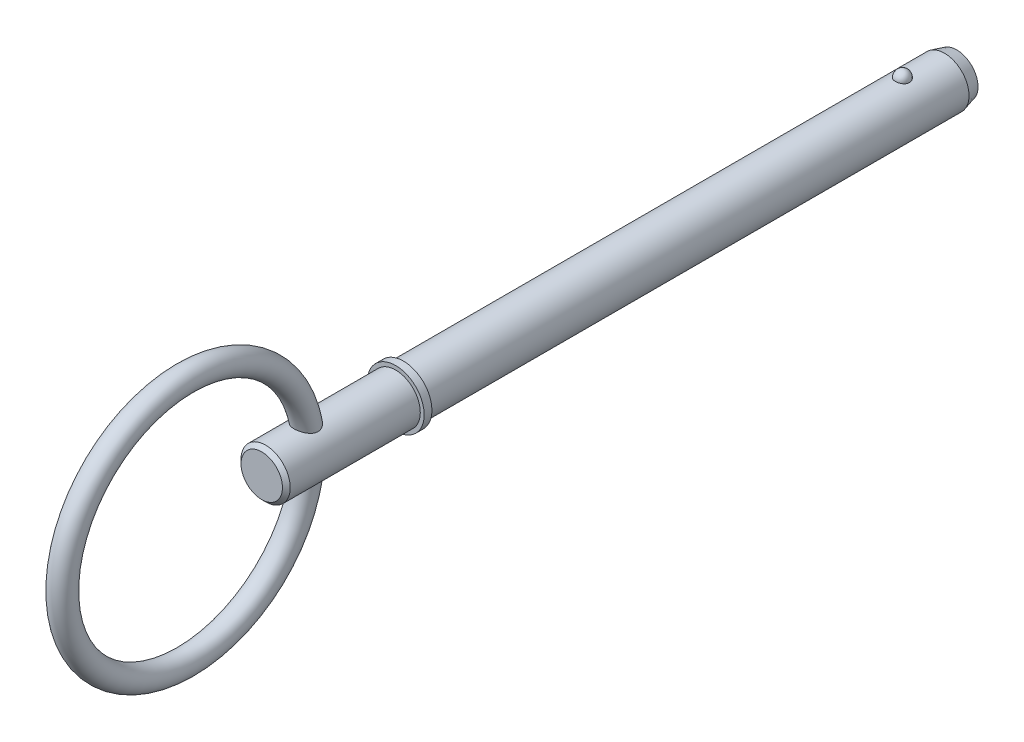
ISO-10303-21;
HEADER;
FILE_DESCRIPTION(('STEP AP214'),'2;1');
FILE_NAME('part.step','',(''),(''),'','','');
FILE_SCHEMA(('AUTOMOTIVE_DESIGN { 1 0 10303 214 1 1 1 1 }'));
ENDSEC;
DATA;
#1=APPLICATION_CONTEXT('core data for automotive mechanical design processes');
#2=APPLICATION_PROTOCOL_DEFINITION('international standard','automotive_design',2000,#1);
#3=PRODUCT_CONTEXT('',#1,'mechanical');
#4=PRODUCT('Part','Part','',(#3));
#5=PRODUCT_RELATED_PRODUCT_CATEGORY('part','',(#4));
#6=PRODUCT_DEFINITION_FORMATION('','',#4);
#7=PRODUCT_DEFINITION_CONTEXT('part definition',#1,'design');
#8=PRODUCT_DEFINITION('design','',#6,#7);
#9=PRODUCT_DEFINITION_SHAPE('','',#8);
#10=(LENGTH_UNIT() NAMED_UNIT(*) SI_UNIT(.MILLI.,.METRE.));
#11=(NAMED_UNIT(*) PLANE_ANGLE_UNIT() SI_UNIT($,.RADIAN.));
#12=(NAMED_UNIT(*) SI_UNIT($,.STERADIAN.) SOLID_ANGLE_UNIT());
#13=UNCERTAINTY_MEASURE_WITH_UNIT(LENGTH_MEASURE(1.E-05),#10,'distance_accuracy_value','');
#14=(GEOMETRIC_REPRESENTATION_CONTEXT(3) GLOBAL_UNCERTAINTY_ASSIGNED_CONTEXT((#13)) GLOBAL_UNIT_ASSIGNED_CONTEXT((#10,
#11,#12)) REPRESENTATION_CONTEXT('',''));
#15=CARTESIAN_POINT('',(0.,0.,0.));
#16=DIRECTION('',(0.,0.,1.));
#17=DIRECTION('',(1.,0.,0.));
#18=AXIS2_PLACEMENT_3D('',#15,#16,#17);
#19=CARTESIAN_POINT('',(0.,0.,63.5));
#20=DIRECTION('',(0.,0.,-1.));
#21=DIRECTION('',(-1.,0.,0.));
#22=AXIS2_PLACEMENT_3D('',#19,#20,#21);
#23=CYLINDRICAL_SURFACE('',#22,3.175);
#24=CARTESIAN_POINT('',(0.90060722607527,3.0445905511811,-0.910000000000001));
#25=CARTESIAN_POINT('',(0.90060646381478,3.04459122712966,-0.859144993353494));
#26=CARTESIAN_POINT('',(0.896466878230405,3.04582460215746,-0.808280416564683));
#27=CARTESIAN_POINT('',(0.88000740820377,3.05062019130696,-0.707994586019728));
#28=CARTESIAN_POINT('',(0.86768478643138,3.05418318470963,-0.658573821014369));
#29=CARTESIAN_POINT('',(0.835170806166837,3.06323316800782,-0.562604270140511));
#30=CARTESIAN_POINT('',(0.814982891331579,3.0687193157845,-0.516054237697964));
#31=CARTESIAN_POINT('',(0.767236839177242,3.08100268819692,-0.427093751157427));
#32=CARTESIAN_POINT('',(0.739678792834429,3.08779989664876,-0.384683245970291));
#33=CARTESIAN_POINT('',(0.677715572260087,3.10198953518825,-0.304951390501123));
#34=CARTESIAN_POINT('',(0.643275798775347,3.10938485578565,-0.267657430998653));
#35=CARTESIAN_POINT('',(0.568522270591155,3.12391647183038,-0.199446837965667));
#36=CARTESIAN_POINT('',(0.528208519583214,3.13105276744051,-0.168530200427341));
#37=CARTESIAN_POINT('',(0.442911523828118,3.14425008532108,-0.114021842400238));
#38=CARTESIAN_POINT('',(0.397942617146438,3.15031426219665,-0.0904084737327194));
#39=CARTESIAN_POINT('',(0.304493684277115,3.16071443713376,-0.051061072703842));
#40=CARTESIAN_POINT('',(0.256014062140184,3.1650506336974,-0.0353261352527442));
#41=CARTESIAN_POINT('',(0.15789136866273,3.17144549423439,-0.0124151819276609));
#42=CARTESIAN_POINT('',(0.108287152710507,3.1735453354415,-0.00508422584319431));
#43=CARTESIAN_POINT('',(0.0085070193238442,3.17538048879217,0.00133254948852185));
#44=CARTESIAN_POINT('',(-0.0416688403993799,3.17511603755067,0.000419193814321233));
#45=CARTESIAN_POINT('',(-0.140377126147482,3.17227395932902,-0.00954840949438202));
#46=CARTESIAN_POINT('',(-0.188922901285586,3.16973088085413,-0.0184810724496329));
#47=CARTESIAN_POINT('',(-0.283780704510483,3.16265029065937,-0.0440659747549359));
#48=CARTESIAN_POINT('',(-0.330092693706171,3.15811274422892,-0.0607183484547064));
#49=CARTESIAN_POINT('',(-0.419493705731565,3.1474895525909,-0.10140675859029));
#50=CARTESIAN_POINT('',(-0.462561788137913,3.14139480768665,-0.125486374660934));
#51=CARTESIAN_POINT('',(-0.54404237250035,3.12831396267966,-0.180346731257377));
#52=CARTESIAN_POINT('',(-0.582454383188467,3.12132776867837,-0.21112817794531));
#53=CARTESIAN_POINT('',(-0.654371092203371,3.10705591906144,-0.279257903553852));
#54=CARTESIAN_POINT('',(-0.687763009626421,3.09976707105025,-0.316724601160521));
#55=CARTESIAN_POINT('',(-0.747869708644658,3.08581767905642,-0.396782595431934));
#56=CARTESIAN_POINT('',(-0.774583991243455,3.07915718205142,-0.43937427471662));
#57=CARTESIAN_POINT('',(-0.820959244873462,3.06712152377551,-0.529074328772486));
#58=CARTESIAN_POINT('',(-0.840531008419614,3.06176288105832,-0.576231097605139));
#59=CARTESIAN_POINT('',(-0.871672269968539,3.0530437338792,-0.673291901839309));
#60=CARTESIAN_POINT('',(-0.883242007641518,3.04968316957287,-0.723195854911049));
#61=CARTESIAN_POINT('',(-0.898057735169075,3.04535343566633,-0.824104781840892));
#62=CARTESIAN_POINT('',(-0.901339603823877,3.04437395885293,-0.875104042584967));
#63=CARTESIAN_POINT('',(-0.89960137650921,3.04488803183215,-0.976947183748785));
#64=CARTESIAN_POINT('',(-0.894581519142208,3.04638151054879,-1.02779106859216));
#65=CARTESIAN_POINT('',(-0.876414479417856,3.051656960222,-1.12760218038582));
#66=CARTESIAN_POINT('',(-0.863310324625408,3.05542681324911,-1.17657789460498));
#67=CARTESIAN_POINT('',(-0.82933491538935,3.06482253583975,-1.27156757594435));
#68=CARTESIAN_POINT('',(-0.808463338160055,3.07044848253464,-1.31758141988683));
#69=CARTESIAN_POINT('',(-0.759325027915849,3.08296842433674,-1.40563218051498));
#70=CARTESIAN_POINT('',(-0.731017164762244,3.08986940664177,-1.44764515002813));
#71=CARTESIAN_POINT('',(-0.667767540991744,3.10415201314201,-1.52624913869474));
#72=CARTESIAN_POINT('',(-0.632825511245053,3.11153365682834,-1.56283993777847));
#73=CARTESIAN_POINT('',(-0.557049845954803,3.12598962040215,-1.62972906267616));
#74=CARTESIAN_POINT('',(-0.516193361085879,3.13306260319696,-1.66000181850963));
#75=CARTESIAN_POINT('',(-0.42979268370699,3.14607829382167,-1.7132172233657));
#76=CARTESIAN_POINT('',(-0.384248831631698,3.15202108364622,-1.73616040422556));
#77=CARTESIAN_POINT('',(-0.290370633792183,3.16204171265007,-1.77380927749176));
#78=CARTESIAN_POINT('',(-0.242079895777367,3.16614263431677,-1.7886174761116));
#79=CARTESIAN_POINT('',(-0.14357928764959,3.17213528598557,-1.81001390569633));
#80=CARTESIAN_POINT('',(-0.0933696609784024,3.1740272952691,-1.81660317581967));
#81=CARTESIAN_POINT('',(0.00648182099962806,3.17537830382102,-1.82132177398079));
#82=CARTESIAN_POINT('',(0.0561153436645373,3.17488455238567,-1.81961539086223));
#83=CARTESIAN_POINT('',(0.154368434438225,3.1716260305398,-1.80816900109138));
#84=CARTESIAN_POINT('',(0.202988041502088,3.16886134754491,-1.79842930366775));
#85=CARTESIAN_POINT('',(0.29764238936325,3.16137318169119,-1.77125024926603));
#86=CARTESIAN_POINT('',(0.343686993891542,3.15665785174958,-1.75384292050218));
#87=CARTESIAN_POINT('',(0.432167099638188,3.14576631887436,-1.71181408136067));
#88=CARTESIAN_POINT('',(0.474602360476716,3.13959001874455,-1.68719209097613));
#89=CARTESIAN_POINT('',(0.555408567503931,3.1263159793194,-1.63094218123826));
#90=CARTESIAN_POINT('',(0.593703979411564,3.11920512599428,-1.59920888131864));
#91=CARTESIAN_POINT('',(0.664472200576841,3.10490064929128,-1.52981493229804));
#92=CARTESIAN_POINT('',(0.696944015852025,3.09770701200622,-1.49215327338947));
#93=CARTESIAN_POINT('',(0.755798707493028,3.08388169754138,-1.41116434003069));
#94=CARTESIAN_POINT('',(0.782059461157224,3.07726269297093,-1.36774610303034));
#95=CARTESIAN_POINT('',(0.827051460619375,3.06547790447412,-1.27699966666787));
#96=CARTESIAN_POINT('',(0.845785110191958,3.06031165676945,-1.22967272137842));
#97=CARTESIAN_POINT('',(0.873798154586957,3.05242388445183,-1.13728658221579));
#98=CARTESIAN_POINT('',(0.883833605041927,3.04951005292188,-1.09247132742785));
#99=CARTESIAN_POINT('',(0.897238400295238,3.0455931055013,-1.00177329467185));
#100=CARTESIAN_POINT('',(0.900607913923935,3.0445899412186,-0.955890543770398));
#101=CARTESIAN_POINT('',(0.90060722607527,3.0445905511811,-0.910000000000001));
#102=B_SPLINE_CURVE_WITH_KNOTS('',3,(#24,#25,#26,#27,#28,#29,#30,#31,#32,#33,#34,#35,#36,#37,
#38,#39,#40,#41,#42,#43,#44,#45,#46,#47,#48,#49,#50,#51,#52,#53,#54,#55,#56,#57,#58,#59,#60,#61,
#62,#63,#64,#65,#66,#67,#68,#69,#70,#71,#72,#73,#74,#75,#76,#77,#78,#79,#80,#81,#82,#83,#84,#85,
#86,#87,#88,#89,#90,#91,#92,#93,#94,#95,#96,#97,#98,#99,#100,#101),.UNSPECIFIED.,.T.,.F.,(4,2,2,
2,2,2,2,2,2,2,2,2,2,2,2,2,2,2,2,2,2,2,2,2,2,2,2,2,2,2,2,2,2,2,2,2,2,2,4),(0.,0.152400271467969,
0.304851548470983,0.45723615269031,0.609618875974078,0.762787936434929,0.915956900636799,
1.06866739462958,1.22136034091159,1.37119044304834,1.52100555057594,1.66858689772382,
1.81617081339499,1.9646377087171,2.1131202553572,2.26455561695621,2.41600229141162,
2.5692805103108,2.72255413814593,2.87516308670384,3.02776764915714,3.1795669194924,
3.33137249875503,3.48403607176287,3.63670583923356,3.78998198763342,3.94324701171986,
4.09453370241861,4.24580126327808,4.39408543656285,4.5423639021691,4.69002878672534,
4.83770349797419,4.9877312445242,5.13778457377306,5.29058018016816,5.44332695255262,
5.58085340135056,5.71837636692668),.UNSPECIFIED.);
#103=CARTESIAN_POINT('',(0.90060722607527,3.0445905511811,-0.910000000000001));
#104=VERTEX_POINT('',#103);
#105=EDGE_CURVE('E100',#104,#104,#102,.T.);
#106=ORIENTED_EDGE('',*,*,#105,.T.);
#107=EDGE_LOOP('',(#106));
#108=FACE_BOUND('',#107,.T.);
#109=CARTESIAN_POINT('',(0.,0.,-6.33399999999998));
#110=DIRECTION('',(0.,0.,-1.));
#111=DIRECTION('',(-1.,0.,0.));
#112=AXIS2_PLACEMENT_3D('',#109,#110,#111);
#113=CIRCLE('',#112,3.175);
#114=CARTESIAN_POINT('',(-3.175,0.,-6.33399999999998));
#115=VERTEX_POINT('',#114);
#116=EDGE_CURVE('E108',#115,#115,#113,.F.);
#117=ORIENTED_EDGE('',*,*,#116,.T.);
#118=EDGE_LOOP('',(#117));
#119=FACE_BOUND('',#118,.T.);
#120=CARTESIAN_POINT('',(0.,0.,63.5));
#121=DIRECTION('',(0.,0.,1.));
#122=DIRECTION('',(1.,0.,0.));
#123=AXIS2_PLACEMENT_3D('',#120,#121,#122);
#124=CIRCLE('',#123,3.175);
#125=CARTESIAN_POINT('',(3.175,0.,63.5));
#126=VERTEX_POINT('',#125);
#127=EDGE_CURVE('E106',#126,#126,#124,.T.);
#128=ORIENTED_EDGE('',*,*,#127,.F.);
#129=EDGE_LOOP('',(#128));
#130=FACE_BOUND('',#129,.T.);
#131=ADVANCED_FACE('F39',(#108,#119,#130),#23,.T.);
#132=CARTESIAN_POINT('',(0.,0.,-7.92));
#133=DIRECTION('',(0.,0.,-1.));
#134=DIRECTION('',(-1.,0.,0.));
#135=AXIS2_PLACEMENT_3D('',#132,#133,#134);
#136=PLANE('',#135);
#137=CARTESIAN_POINT('',(0.,0.,-7.92));
#138=DIRECTION('',(0.,0.,-1.));
#139=DIRECTION('',(-1.,0.,0.));
#140=AXIS2_PLACEMENT_3D('',#137,#138,#139);
#141=CIRCLE('',#140,2.75003258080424);
#142=CARTESIAN_POINT('',(-2.75003258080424,0.,-7.92));
#143=VERTEX_POINT('',#142);
#144=EDGE_CURVE('E142',#143,#143,#141,.T.);
#145=ORIENTED_EDGE('',*,*,#144,.T.);
#146=EDGE_LOOP('',(#145));
#147=FACE_BOUND('',#146,.T.);
#148=ADVANCED_FACE('F86',(#147),#136,.T.);
#149=CARTESIAN_POINT('',(0.,0.,-7.92));
#150=DIRECTION('',(0.,0.,1.));
#151=DIRECTION('',(1.,0.,0.));
#152=AXIS2_PLACEMENT_3D('',#149,#150,#151);
#153=CONICAL_SURFACE('',#152,2.75003258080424,0.261799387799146);
#154=ORIENTED_EDGE('',*,*,#116,.F.);
#155=EDGE_LOOP('',(#154));
#156=FACE_BOUND('',#155,.T.);
#157=ORIENTED_EDGE('',*,*,#144,.F.);
#158=EDGE_LOOP('',(#157));
#159=FACE_BOUND('',#158,.T.);
#160=ADVANCED_FACE('F92',(#156,#159),#153,.T.);
#161=CARTESIAN_POINT('',(0.,3.175,-0.910000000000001));
#162=DIRECTION('',(0.,1.,0.));
#163=DIRECTION('',(0.,0.,-1.));
#164=AXIS2_PLACEMENT_3D('',#161,#162,#163);
#165=SPHERICAL_SURFACE('',#164,0.91);
#166=ORIENTED_EDGE('',*,*,#105,.F.);
#167=EDGE_LOOP('',(#166));
#168=FACE_BOUND('',#167,.T.);
#169=ADVANCED_FACE('F111',(#168),#165,.T.);
#170=CARTESIAN_POINT('',(0.,0.,63.5));
#171=DIRECTION('',(0.,0.,-1.));
#172=DIRECTION('',(-1.,0.,0.));
#173=AXIS2_PLACEMENT_3D('',#170,#171,#172);
#174=PLANE('',#173);
#175=ORIENTED_EDGE('',*,*,#127,.T.);
#176=EDGE_LOOP('',(#175));
#177=FACE_BOUND('',#176,.T.);
#178=CARTESIAN_POINT('',(0.,0.,63.5));
#179=DIRECTION('',(0.,0.,-1.));
#180=DIRECTION('',(-1.,0.,0.));
#181=AXIS2_PLACEMENT_3D('',#178,#179,#180);
#182=CIRCLE('',#181,3.675);
#183=CARTESIAN_POINT('',(-3.675,0.,63.5));
#184=VERTEX_POINT('',#183);
#185=EDGE_CURVE('E107',#184,#184,#182,.T.);
#186=ORIENTED_EDGE('',*,*,#185,.T.);
#187=EDGE_LOOP('',(#186));
#188=FACE_BOUND('',#187,.T.);
#189=ADVANCED_FACE('F115',(#177,#188),#174,.T.);
#190=CARTESIAN_POINT('',(0.,0.,33.7287874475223));
#191=DIRECTION('',(0.,0.,-1.));
#192=DIRECTION('',(-1.,0.,0.));
#193=AXIS2_PLACEMENT_3D('',#190,#191,#192);
#194=CYLINDRICAL_SURFACE('',#193,3.675);
#195=CARTESIAN_POINT('',(0.,0.,64.5));
#196=DIRECTION('',(0.,0.,-1.));
#197=DIRECTION('',(-1.,0.,0.));
#198=AXIS2_PLACEMENT_3D('',#195,#196,#197);
#199=CIRCLE('',#198,3.675);
#200=CARTESIAN_POINT('',(-3.675,0.,64.5));
#201=VERTEX_POINT('',#200);
#202=EDGE_CURVE('E132',#201,#201,#199,.T.);
#203=ORIENTED_EDGE('',*,*,#202,.T.);
#204=EDGE_LOOP('',(#203));
#205=FACE_BOUND('',#204,.T.);
#206=ORIENTED_EDGE('',*,*,#185,.F.);
#207=EDGE_LOOP('',(#206));
#208=FACE_BOUND('',#207,.T.);
#209=ADVANCED_FACE('F119',(#205,#208),#194,.T.);
#210=CARTESIAN_POINT('',(0.,3.675,64.5));
#211=DIRECTION('',(0.,0.,1.));
#212=DIRECTION('',(1.,0.,0.));
#213=AXIS2_PLACEMENT_3D('',#210,#211,#212);
#214=PLANE('',#213);
#215=CARTESIAN_POINT('',(0.,0.,64.5));
#216=DIRECTION('',(0.,0.,1.));
#217=DIRECTION('',(1.,0.,0.));
#218=AXIS2_PLACEMENT_3D('',#215,#216,#217);
#219=CIRCLE('',#218,3.175);
#220=CARTESIAN_POINT('',(3.175,0.,64.5));
#221=VERTEX_POINT('',#220);
#222=EDGE_CURVE('E110',#221,#221,#219,.T.);
#223=ORIENTED_EDGE('',*,*,#222,.F.);
#224=EDGE_LOOP('',(#223));
#225=FACE_BOUND('',#224,.T.);
#226=ORIENTED_EDGE('',*,*,#202,.F.);
#227=EDGE_LOOP('',(#226));
#228=FACE_BOUND('',#227,.T.);
#229=ADVANCED_FACE('F83',(#225,#228),#214,.T.);
#230=CARTESIAN_POINT('',(0.,0.,81.79));
#231=DIRECTION('',(0.,0.,-1.));
#232=DIRECTION('',(-1.,0.,0.));
#233=AXIS2_PLACEMENT_3D('',#230,#231,#232);
#234=CYLINDRICAL_SURFACE('',#233,3.175);
#235=CARTESIAN_POINT('',(-0.793622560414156,-3.07421343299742,74.7949618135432));
#236=CARTESIAN_POINT('',(-0.723928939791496,-3.09220199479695,74.7540743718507));
#237=CARTESIAN_POINT('',(-0.650537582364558,-3.10860299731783,74.7186572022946));
#238=CARTESIAN_POINT('',(-0.498225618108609,-3.13662262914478,74.65960803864));
#239=CARTESIAN_POINT('',(-0.41929921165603,-3.14823615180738,74.635988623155));
#240=CARTESIAN_POINT('',(-0.258022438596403,-3.16553731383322,74.6011787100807));
#241=CARTESIAN_POINT('',(-0.175668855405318,-3.17121924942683,74.5900001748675));
#242=CARTESIAN_POINT('',(-0.0100583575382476,-3.17606405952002,74.5804538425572));
#243=CARTESIAN_POINT('',(0.0731982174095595,-3.17522930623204,74.5820813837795));
#244=CARTESIAN_POINT('',(0.236345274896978,-3.16722178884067,74.5979075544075));
#245=CARTESIAN_POINT('',(0.316269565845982,-3.16018772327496,74.6118310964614));
#246=CARTESIAN_POINT('',(0.472429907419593,-3.14064183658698,74.6514871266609));
#247=CARTESIAN_POINT('',(0.548665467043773,-3.12812928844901,74.6772211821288));
#248=CARTESIAN_POINT('',(0.696533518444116,-3.0985857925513,74.7403145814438));
#249=CARTESIAN_POINT('',(0.768085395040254,-3.08149328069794,74.7778336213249));
#250=CARTESIAN_POINT('',(0.90366694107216,-3.04449595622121,74.863584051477));
#251=CARTESIAN_POINT('',(0.967693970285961,-3.02459016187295,74.9118191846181));
#252=CARTESIAN_POINT('',(1.08889306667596,-2.98315111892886,75.0200855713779));
#253=CARTESIAN_POINT('',(1.14572430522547,-2.96158491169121,75.0804869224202));
#254=CARTESIAN_POINT('',(1.24806454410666,-2.91993487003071,75.2106874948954));
#255=CARTESIAN_POINT('',(1.29357550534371,-2.89985077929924,75.2804850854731));
#256=CARTESIAN_POINT('',(1.37094214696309,-2.86407549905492,75.4262600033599));
#257=CARTESIAN_POINT('',(1.40307792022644,-2.84829687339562,75.5020662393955));
#258=CARTESIAN_POINT('',(1.45397574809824,-2.82265933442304,75.6589553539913));
#259=CARTESIAN_POINT('',(1.47274938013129,-2.81279529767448,75.7400335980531));
#260=CARTESIAN_POINT('',(1.49549698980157,-2.80076108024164,75.8979026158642));
#261=CARTESIAN_POINT('',(1.50056337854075,-2.79802369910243,75.9744958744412));
#262=CARTESIAN_POINT('',(1.49933665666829,-2.79868066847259,76.1275541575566));
#263=CARTESIAN_POINT('',(1.49304097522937,-2.80207640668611,76.2040191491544));
#264=CARTESIAN_POINT('',(1.46976618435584,-2.81435249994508,76.3552802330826));
#265=CARTESIAN_POINT('',(1.45272287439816,-2.82326580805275,76.4300634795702));
#266=CARTESIAN_POINT('',(1.40884990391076,-2.84541139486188,76.5760088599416));
#267=CARTESIAN_POINT('',(1.38201642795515,-2.85864535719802,76.6471695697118));
#268=CARTESIAN_POINT('',(1.31496449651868,-2.89016475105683,76.7946079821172));
#269=CARTESIAN_POINT('',(1.27338339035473,-2.9089013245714,76.8701693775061));
#270=CARTESIAN_POINT('',(1.17952729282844,-2.94820796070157,77.0139034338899));
#271=CARTESIAN_POINT('',(1.12723913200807,-2.96878026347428,77.0820668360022));
#272=CARTESIAN_POINT('',(1.00570728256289,-3.01228109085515,77.2173106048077));
#273=CARTESIAN_POINT('',(0.935174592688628,-3.03519170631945,77.2832498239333));
#274=CARTESIAN_POINT('',(0.782605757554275,-3.07805054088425,77.401321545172));
#275=CARTESIAN_POINT('',(0.700588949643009,-3.09800362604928,77.4534768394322));
#276=CARTESIAN_POINT('',(0.549003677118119,-3.12787153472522,77.5296423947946));
#277=CARTESIAN_POINT('',(0.481582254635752,-3.1390487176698,77.5574376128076));
#278=CARTESIAN_POINT('',(0.342696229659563,-3.15722518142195,77.6021563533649));
#279=CARTESIAN_POINT('',(0.27123564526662,-3.16422853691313,77.6190904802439));
#280=CARTESIAN_POINT('',(0.125873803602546,-3.17334230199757,77.6410622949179));
#281=CARTESIAN_POINT('',(0.0519637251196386,-3.17543249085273,77.6460508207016));
#282=CARTESIAN_POINT('',(-0.0956207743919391,-3.17441743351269,77.6436180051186));
#283=CARTESIAN_POINT('',(-0.169295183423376,-3.1713119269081,77.6361960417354));
#284=CARTESIAN_POINT('',(-0.309449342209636,-3.16061694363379,77.6103375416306));
#285=CARTESIAN_POINT('',(-0.376089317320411,-3.15332372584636,77.5926279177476));
#286=CARTESIAN_POINT('',(-0.505583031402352,-3.13517004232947,77.5477876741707));
#287=CARTESIAN_POINT('',(-0.568435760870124,-3.12430863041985,77.5206545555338));
#288=CARTESIAN_POINT('',(-0.694306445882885,-3.09887452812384,77.4555626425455));
#289=CARTESIAN_POINT('',(-0.756907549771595,-3.08406907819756,77.4168937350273));
#290=CARTESIAN_POINT('',(-0.875645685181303,-3.05248288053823,77.3313455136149));
#291=CARTESIAN_POINT('',(-0.931779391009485,-3.03570112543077,77.2844620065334));
#292=CARTESIAN_POINT('',(-1.0463923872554,-2.99832170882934,77.1747926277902));
#293=CARTESIAN_POINT('',(-1.10353654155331,-2.97757338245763,77.1106605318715));
#294=CARTESIAN_POINT('',(-1.20755858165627,-2.93692907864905,76.9742268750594));
#295=CARTESIAN_POINT('',(-1.25442453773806,-2.91703411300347,76.9019159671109));
#296=CARTESIAN_POINT('',(-1.34199791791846,-2.87788786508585,76.7412794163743));
#297=CARTESIAN_POINT('',(-1.38127718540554,-2.85900475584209,76.6520744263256));
#298=CARTESIAN_POINT('',(-1.44406659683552,-2.82781619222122,76.4671839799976));
#299=CARTESIAN_POINT('',(-1.46759319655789,-2.81550387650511,76.3715054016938));
#300=CARTESIAN_POINT('',(-1.49571801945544,-2.8006591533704,76.1845771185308));
#301=CARTESIAN_POINT('',(-1.50169726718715,-2.79741422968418,76.093598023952));
#302=CARTESIAN_POINT('',(-1.49747735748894,-2.79967890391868,75.9121564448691));
#303=CARTESIAN_POINT('',(-1.48729863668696,-2.80517744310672,75.8216934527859));
#304=CARTESIAN_POINT('',(-1.45348639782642,-2.82281521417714,75.6584626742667));
#305=CARTESIAN_POINT('',(-1.43212237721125,-2.83382344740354,75.5850889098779));
#306=CARTESIAN_POINT('',(-1.37828411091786,-2.86039426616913,75.4433903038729));
#307=CARTESIAN_POINT('',(-1.34580440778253,-2.87595908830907,75.3750679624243));
#308=CARTESIAN_POINT('',(-1.27066760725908,-2.90993532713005,75.2450336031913));
#309=CARTESIAN_POINT('',(-1.22800357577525,-2.9283486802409,75.183326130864));
#310=CARTESIAN_POINT('',(-1.13363307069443,-2.96615489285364,75.0677083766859));
#311=CARTESIAN_POINT('',(-1.08193541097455,-2.98554678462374,75.0137905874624));
#312=CARTESIAN_POINT('',(-0.990573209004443,-3.01675653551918,74.9323094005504));
#313=CARTESIAN_POINT('',(-0.953209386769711,-3.02880489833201,74.9022130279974));
#314=CARTESIAN_POINT('',(-0.875544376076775,-3.0521621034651,74.8457477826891));
#315=CARTESIAN_POINT('',(-0.835242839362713,-3.06347085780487,74.8193793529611));
#316=CARTESIAN_POINT('',(-0.793622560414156,-3.07421343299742,74.7949618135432));
#317=B_SPLINE_CURVE_WITH_KNOTS('',3,(#235,#236,#237,#238,#239,#240,#241,#242,#243,#244,#245,
#246,#247,#248,#249,#250,#251,#252,#253,#254,#255,#256,#257,#258,#259,#260,#261,#262,#263,#264,
#265,#266,#267,#268,#269,#270,#271,#272,#273,#274,#275,#276,#277,#278,#279,#280,#281,#282,#283,
#284,#285,#286,#287,#288,#289,#290,#291,#292,#293,#294,#295,#296,#297,#298,#299,#300,#301,#302,
#303,#304,#305,#306,#307,#308,#309,#310,#311,#312,#313,#314,#315,#316),.UNSPECIFIED.,.T.,.F.,(4,
2,2,2,2,2,2,2,2,2,2,2,2,2,2,2,2,2,2,2,2,2,2,2,2,2,2,2,2,2,2,2,2,2,2,2,2,2,2,2,4),(0.,
0.248167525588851,0.496599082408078,0.745269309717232,0.993849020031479,1.23700449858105,
1.48019225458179,1.72682894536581,1.97355191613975,2.22939388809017,2.48519151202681,
2.73532416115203,2.98523982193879,3.21455414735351,3.44392036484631,3.67466984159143,
3.90550934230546,4.16925064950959,4.43331832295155,4.72951976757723,5.02522832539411,
5.24564983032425,5.46585579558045,5.68696647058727,5.90808822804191,6.11521387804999,
6.32239449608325,6.54672206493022,6.77116447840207,7.03522663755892,7.29959368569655,
7.59590092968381,7.89189815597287,8.163876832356,8.43551178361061,8.66603557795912,
8.89667271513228,9.1274673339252,9.35803801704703,9.50622339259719,9.6544263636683),.UNSPECIFIED.);
#318=CARTESIAN_POINT('',(-0.793622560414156,-3.07421343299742,74.7949618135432));
#319=VERTEX_POINT('',#318);
#320=EDGE_CURVE('E10',#319,#319,#317,.T.);
#321=ORIENTED_EDGE('',*,*,#320,.F.);
#322=EDGE_LOOP('',(#321));
#323=FACE_BOUND('',#322,.T.);
#324=CARTESIAN_POINT('',(-0.793622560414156,3.07421343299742,74.7949618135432));
#325=CARTESIAN_POINT('',(-0.86460683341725,3.05588589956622,74.8366128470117));
#326=CARTESIAN_POINT('',(-0.931875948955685,3.03587991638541,74.8840114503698));
#327=CARTESIAN_POINT('',(-1.05725170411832,2.99453227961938,74.9893775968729));
#328=CARTESIAN_POINT('',(-1.11534118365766,2.97318822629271,75.0473645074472));
#329=CARTESIAN_POINT('',(-1.22080462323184,2.93146441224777,75.172887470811));
#330=CARTESIAN_POINT('',(-1.26816209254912,2.91108617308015,75.2404379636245));
#331=CARTESIAN_POINT('',(-1.35052787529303,2.87380473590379,75.3835086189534));
#332=CARTESIAN_POINT('',(-1.38554886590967,2.85689797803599,75.4590204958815));
#333=CARTESIAN_POINT('',(-1.44074287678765,2.82945202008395,75.6122947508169));
#334=CARTESIAN_POINT('',(-1.46153301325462,2.81865228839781,75.6897872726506));
#335=CARTESIAN_POINT('',(-1.49023441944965,2.80358650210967,75.8477206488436));
#336=CARTESIAN_POINT('',(-1.49815016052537,2.79931817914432,75.9281604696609));
#337=CARTESIAN_POINT('',(-1.50117056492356,2.79769676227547,76.0840076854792));
#338=CARTESIAN_POINT('',(-1.49708260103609,2.79990784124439,76.1593985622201));
#339=CARTESIAN_POINT('',(-1.4784698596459,2.80977909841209,76.3084983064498));
#340=CARTESIAN_POINT('',(-1.46394166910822,2.8174410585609,76.3822066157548));
#341=CARTESIAN_POINT('',(-1.42400377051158,2.83784609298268,76.5313443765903));
#342=CARTESIAN_POINT('',(-1.39791960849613,2.85090002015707,76.6065484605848));
#343=CARTESIAN_POINT('',(-1.33585690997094,2.8805017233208,76.7520384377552));
#344=CARTESIAN_POINT('',(-1.29987052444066,2.89705226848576,76.8223203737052));
#345=CARTESIAN_POINT('',(-1.21229019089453,2.93489412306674,76.9677405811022));
#346=CARTESIAN_POINT('',(-1.15911759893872,2.95651988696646,77.0418449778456));
#347=CARTESIAN_POINT('',(-1.04143166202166,2.99999612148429,77.1803805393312));
#348=CARTESIAN_POINT('',(-0.976918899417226,3.0218465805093,77.244812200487));
#349=CARTESIAN_POINT('',(-0.845368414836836,3.06106710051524,77.3552302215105));
#350=CARTESIAN_POINT('',(-0.77946649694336,3.0786636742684,77.4024840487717));
#351=CARTESIAN_POINT('',(-0.640261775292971,3.11059085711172,77.4859540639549));
#352=CARTESIAN_POINT('',(-0.566963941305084,3.12492363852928,77.5221775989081));
#353=CARTESIAN_POINT('',(-0.413802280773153,3.14887886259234,77.5818109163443));
#354=CARTESIAN_POINT('',(-0.333888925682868,3.15846114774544,77.6051116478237));
#355=CARTESIAN_POINT('',(-0.170660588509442,3.17146222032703,77.6365717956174));
#356=CARTESIAN_POINT('',(-0.0873493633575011,3.17488763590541,77.6447474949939));
#357=CARTESIAN_POINT('',(0.0674621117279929,3.17509166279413,77.6452317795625));
#358=CARTESIAN_POINT('',(0.138963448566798,3.17274321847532,77.6396242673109));
#359=CARTESIAN_POINT('',(0.27985527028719,3.16342998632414,77.6171581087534));
#360=CARTESIAN_POINT('',(0.349245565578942,3.15646478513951,77.6002984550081));
#361=CARTESIAN_POINT('',(0.483013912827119,3.13875920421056,77.5567119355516));
#362=CARTESIAN_POINT('',(0.54745548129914,3.12808257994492,77.5301513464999));
#363=CARTESIAN_POINT('',(0.671431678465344,3.10383639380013,77.4683782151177));
#364=CARTESIAN_POINT('',(0.73096479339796,3.09026594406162,77.4331630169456));
#365=CARTESIAN_POINT('',(0.852308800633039,3.0591902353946,77.3498716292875));
#366=CARTESIAN_POINT('',(0.91328416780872,3.04140021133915,77.3006877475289));
#367=CARTESIAN_POINT('',(1.0273242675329,3.00480015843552,77.1941850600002));
#368=CARTESIAN_POINT('',(1.08038247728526,2.98598930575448,77.1368596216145));
#369=CARTESIAN_POINT('',(1.18657794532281,2.94557646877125,77.0046952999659));
#370=CARTESIAN_POINT('',(1.23812372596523,2.92405810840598,76.9285445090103));
#371=CARTESIAN_POINT('',(1.32862928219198,2.88406370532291,76.7682796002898));
#372=CARTESIAN_POINT('',(1.36758013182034,2.86558982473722,76.6841598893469));
#373=CARTESIAN_POINT('',(1.43274280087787,2.83359383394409,76.5061421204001));
#374=CARTESIAN_POINT('',(1.45837682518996,2.82030175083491,76.4119863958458));
#375=CARTESIAN_POINT('',(1.49241322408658,2.80245006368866,76.2198495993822));
#376=CARTESIAN_POINT('',(1.50084951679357,2.79787327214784,76.1218764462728));
#377=CARTESIAN_POINT('',(1.49914798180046,2.7987793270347,75.9405073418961));
#378=CARTESIAN_POINT('',(1.49154990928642,2.80288682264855,75.857078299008));
#379=CARTESIAN_POINT('',(1.46253136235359,2.81813655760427,75.6933228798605));
#380=CARTESIAN_POINT('',(1.44111368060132,2.82927737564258,75.6129958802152));
#381=CARTESIAN_POINT('',(1.38785163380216,2.85574398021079,75.4657200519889));
#382=CARTESIAN_POINT('',(1.3572264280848,2.87055627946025,75.3982302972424));
#383=CARTESIAN_POINT('',(1.28612163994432,2.90310901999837,75.2694446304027));
#384=CARTESIAN_POINT('',(1.24564038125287,2.92084995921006,75.208149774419));
#385=CARTESIAN_POINT('',(1.1532082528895,2.95860856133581,75.0894756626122));
#386=CARTESIAN_POINT('',(1.10072548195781,2.97869868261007,75.0325343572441));
#387=CARTESIAN_POINT('',(0.987118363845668,3.01825121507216,74.9277702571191));
#388=CARTESIAN_POINT('',(0.925990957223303,3.03771340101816,74.8799507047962));
#389=CARTESIAN_POINT('',(0.792065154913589,3.07545294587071,74.7913571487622));
#390=CARTESIAN_POINT('',(0.718757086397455,3.09356121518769,74.7512781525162));
#391=CARTESIAN_POINT('',(0.565747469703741,3.12516438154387,74.6833730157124));
#392=CARTESIAN_POINT('',(0.486046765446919,3.13865988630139,74.6555452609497));
#393=CARTESIAN_POINT('',(0.323293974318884,3.15955163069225,74.6130890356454));
#394=CARTESIAN_POINT('',(0.240283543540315,3.16700771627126,74.5983309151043));
#395=CARTESIAN_POINT('',(0.0726303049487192,3.17527774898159,74.5819853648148));
#396=CARTESIAN_POINT('',(-0.0120126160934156,3.17609123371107,74.5803988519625));
#397=CARTESIAN_POINT('',(-0.177340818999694,3.17108555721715,74.5902649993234));
#398=CARTESIAN_POINT('',(-0.258061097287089,3.16549698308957,74.6012643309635));
#399=CARTESIAN_POINT('',(-0.416230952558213,3.1486007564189,74.635250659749));
#400=CARTESIAN_POINT('',(-0.493684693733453,3.13730063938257,74.6582218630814));
#401=CARTESIAN_POINT('',(-0.607599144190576,3.11657538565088,74.7018364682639));
#402=CARTESIAN_POINT('',(-0.64599981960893,3.10882447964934,74.7183691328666));
#403=CARTESIAN_POINT('',(-0.721122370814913,3.092262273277,74.7544352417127));
#404=CARTESIAN_POINT('',(-0.757844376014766,3.08345105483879,74.7739684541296));
#405=CARTESIAN_POINT('',(-0.793622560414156,3.07421343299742,74.7949618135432));
#406=B_SPLINE_CURVE_WITH_KNOTS('',3,(#324,#325,#326,#327,#328,#329,#330,#331,#332,#333,#334,
#335,#336,#337,#338,#339,#340,#341,#342,#343,#344,#345,#346,#347,#348,#349,#350,#351,#352,#353,
#354,#355,#356,#357,#358,#359,#360,#361,#362,#363,#364,#365,#366,#367,#368,#369,#370,#371,#372,
#373,#374,#375,#376,#377,#378,#379,#380,#381,#382,#383,#384,#385,#386,#387,#388,#389,#390,#391,
#392,#393,#394,#395,#396,#397,#398,#399,#400,#401,#402,#403,#404,#405),.UNSPECIFIED.,.T.,.F.,(4,
2,2,2,2,2,2,2,2,2,2,2,2,2,2,2,2,2,2,2,2,2,2,2,2,2,2,2,2,2,2,2,2,2,2,2,2,2,2,2,4),(0.,
0.252800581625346,0.506068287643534,0.75972256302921,1.01311541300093,1.25467278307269,
1.49614624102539,1.72175790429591,1.94744335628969,2.18851823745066,2.42978476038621,
2.7098131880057,2.98982723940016,3.23776482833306,3.48553690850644,3.73536921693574,
3.98493240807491,4.19913817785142,4.41336312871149,4.62407643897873,4.83485449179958,
5.07495869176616,5.31525962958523,5.59735778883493,5.87965543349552,6.17335015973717,
6.46646508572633,6.71664398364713,6.96677234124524,7.19253107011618,7.4183282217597,
7.6573166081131,7.89638978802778,8.15162793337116,8.40683243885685,8.65947601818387,
8.91213718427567,9.15597668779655,9.39949531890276,9.5269241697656,9.65434318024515),.UNSPECIFIED.);
#407=CARTESIAN_POINT('',(-0.793622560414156,3.07421343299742,74.7949618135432));
#408=VERTEX_POINT('',#407);
#409=EDGE_CURVE('E51',#408,#408,#406,.T.);
#410=ORIENTED_EDGE('',*,*,#409,.F.);
#411=EDGE_LOOP('',(#410));
#412=FACE_BOUND('',#411,.T.);
#413=CARTESIAN_POINT('',(0.,0.,81.29));
#414=DIRECTION('',(0.,0.,-1.));
#415=DIRECTION('',(-1.,0.,0.));
#416=AXIS2_PLACEMENT_3D('',#413,#414,#415);
#417=CIRCLE('',#416,3.175);
#418=CARTESIAN_POINT('',(-3.175,0.,81.29));
#419=VERTEX_POINT('',#418);
#420=EDGE_CURVE('E62',#419,#419,#417,.T.);
#421=ORIENTED_EDGE('',*,*,#420,.T.);
#422=EDGE_LOOP('',(#421));
#423=FACE_BOUND('',#422,.T.);
#424=ORIENTED_EDGE('',*,*,#222,.T.);
#425=EDGE_LOOP('',(#424));
#426=FACE_BOUND('',#425,.T.);
#427=ADVANCED_FACE('F67',(#323,#412,#423,#426),#234,.T.);
#428=CARTESIAN_POINT('',(0.,0.,81.79));
#429=DIRECTION('',(0.,0.,-1.));
#430=DIRECTION('',(-1.,0.,0.));
#431=AXIS2_PLACEMENT_3D('',#428,#429,#430);
#432=PLANE('',#431);
#433=CARTESIAN_POINT('',(0.,0.,81.79));
#434=DIRECTION('',(0.,0.,-1.));
#435=DIRECTION('',(-1.,0.,0.));
#436=AXIS2_PLACEMENT_3D('',#433,#434,#435);
#437=CIRCLE('',#436,2.675);
#438=CARTESIAN_POINT('',(-2.675,0.,81.79));
#439=VERTEX_POINT('',#438);
#440=EDGE_CURVE('E56',#439,#439,#437,.F.);
#441=ORIENTED_EDGE('',*,*,#440,.T.);
#442=EDGE_LOOP('',(#441));
#443=FACE_BOUND('',#442,.T.);
#444=ADVANCED_FACE('F74',(#443),#432,.F.);
#445=CARTESIAN_POINT('',(0.,0.,81.29));
#446=DIRECTION('',(0.,0.,-1.));
#447=DIRECTION('',(-1.,0.,0.));
#448=AXIS2_PLACEMENT_3D('',#445,#446,#447);
#449=CONICAL_SURFACE('',#448,3.175,0.785398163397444);
#450=ORIENTED_EDGE('',*,*,#440,.F.);
#451=EDGE_LOOP('',(#450));
#452=FACE_BOUND('',#451,.T.);
#453=ORIENTED_EDGE('',*,*,#420,.F.);
#454=EDGE_LOOP('',(#453));
#455=FACE_BOUND('',#454,.T.);
#456=ADVANCED_FACE('F41',(#452,#455),#449,.T.);
#457=CARTESIAN_POINT('',(0.,0.,91.665));
#458=DIRECTION('',(1.,0.,0.));
#459=DIRECTION('',(0.,0.,-1.));
#460=AXIS2_PLACEMENT_3D('',#457,#458,#459);
#461=TOROIDAL_SURFACE('',#460,15.875,1.5);
#462=ORIENTED_EDGE('',*,*,#320,.T.);
#463=EDGE_LOOP('',(#462));
#464=FACE_BOUND('',#463,.T.);
#465=ORIENTED_EDGE('',*,*,#409,.T.);
#466=EDGE_LOOP('',(#465));
#467=FACE_BOUND('',#466,.T.);
#468=ADVANCED_FACE('F71',(#464,#467),#461,.T.);
#469=CLOSED_SHELL('',(#131,#148,#160,#169,#189,#209,#229,#427,#444,#456,#468));
#470=MANIFOLD_SOLID_BREP('B2',#469);
#471=ADVANCED_BREP_SHAPE_REPRESENTATION('',(#18,#470),#14);
#472=SHAPE_DEFINITION_REPRESENTATION(#9,#471);
ENDSEC;
END-ISO-10303-21;
